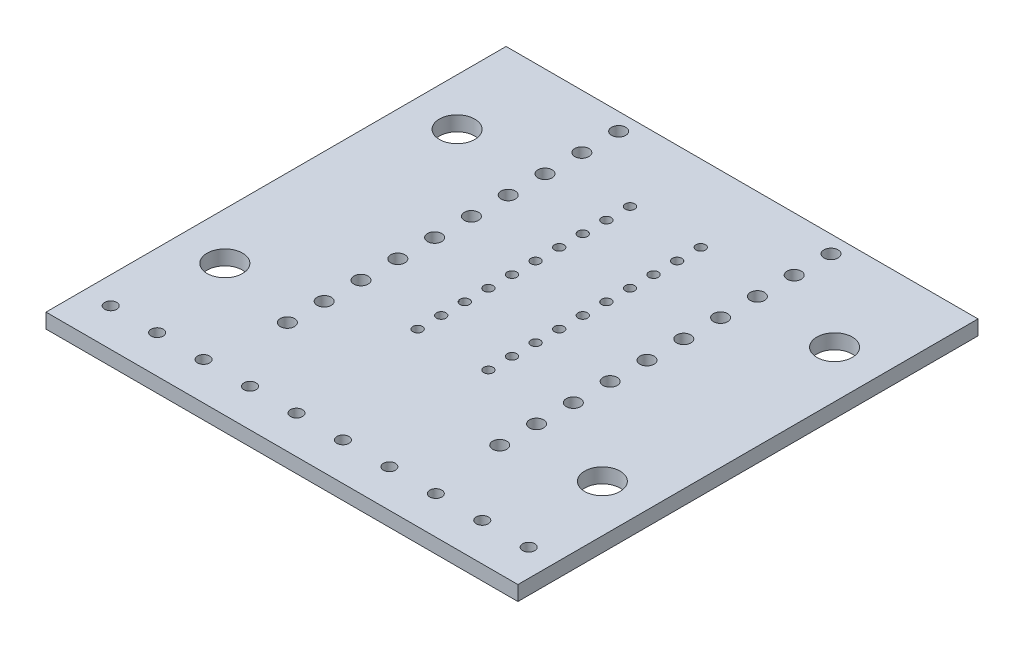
from build123d import *

# Parameters (mm, degrees)
SKETCH1_W           = 50.8
SKETCH1_H           = 49.53
SKETCH1_R           = 0.65
SKETCH1_R_2         = 1.905
SKETCH1_R_3         = 0.762
SKETCH1_R_4         = 0.508
BOSS_EXTRUDE1_DEPTH = 1.5875


with BuildPart() as part:
    # Sketch1 → Boss-Extrude1 (new body)
    with BuildSketch(Plane(origin=(0, 0, 0), x_dir=(1, 0, 0), z_dir=(0, 1, 0))):
        with Locations((0, 24.765)):
            Rectangle(SKETCH1_W, SKETCH1_H)
        with Locations(Location((-22.49932, 4.064, 0), (0, 0, 270))):
            Circle(SKETCH1_R, mode=Mode.SUBTRACT)
        with Locations(Location((-17.5006, 4.064, 0), (0, 0, 270))):
            Circle(SKETCH1_R, mode=Mode.SUBTRACT)
        with Locations(Location((-12.49934, 4.064, 0), (0, 0, 270))):
            Circle(SKETCH1_R, mode=Mode.SUBTRACT)
        with Locations(Location((-7.50062, 4.064, 0), (0, 0, 270))):
            Circle(SKETCH1_R, mode=Mode.SUBTRACT)
        with Locations(Location((-2.49936, 4.064, 0), (0, 0, 270))):
            Circle(SKETCH1_R, mode=Mode.SUBTRACT)
        with Locations(Location((-20.32, 14.1732, 0), (0, 0, 270))):
            Circle(SKETCH1_R_2, mode=Mode.SUBTRACT)
        with Locations(Location((-20.32, 39.16934, 0), (0, 0, 270))):
            Circle(SKETCH1_R_2, mode=Mode.SUBTRACT)
        with Locations(Location((-11.43, 12.0142, 0), (0, 0, 270))):
            Circle(SKETCH1_R_3, mode=Mode.SUBTRACT)
        with Locations(Location((-11.43, 15.9766, 0), (0, 0, 270))):
            Circle(SKETCH1_R_3, mode=Mode.SUBTRACT)
        with Locations(Location((-11.43, 19.939, 0), (0, 0, 270))):
            Circle(SKETCH1_R_3, mode=Mode.SUBTRACT)
        with Locations(Location((-11.43, 23.9014, 0), (0, 0, 270))):
            Circle(SKETCH1_R_3, mode=Mode.SUBTRACT)
        with Locations(Location((-11.43, 27.8638, 0), (0, 0, 270))):
            Circle(SKETCH1_R_3, mode=Mode.SUBTRACT)
        with Locations(Location((-11.43, 31.8262, 0), (0, 0, 270))):
            Circle(SKETCH1_R_3, mode=Mode.SUBTRACT)
        with Locations(Location((-11.43, 35.7886, 0), (0, 0, 270))):
            Circle(SKETCH1_R_3, mode=Mode.SUBTRACT)
        with Locations(Location((-11.43, 39.751, 0), (0, 0, 270))):
            Circle(SKETCH1_R_3, mode=Mode.SUBTRACT)
        with Locations(Location((-11.43, 43.7134, 0), (0, 0, 270))):
            Circle(SKETCH1_R_3, mode=Mode.SUBTRACT)
        with Locations(Location((-11.43, 47.6758, 0), (0, 0, 270))):
            Circle(SKETCH1_R_3, mode=Mode.SUBTRACT)
        with Locations(Location((-3.81, 18.415, 0), (0, 0, 270))):
            Circle(SKETCH1_R_4, mode=Mode.SUBTRACT)
        with Locations(Location((3.81, 41.275, 0), (0, 0, 90))):
            Circle(SKETCH1_R_4, mode=Mode.SUBTRACT)
        with Locations(Location((3.81, 38.735, 0), (0, 0, 90))):
            Circle(SKETCH1_R_4, mode=Mode.SUBTRACT)
        with Locations(Location((3.81, 36.195, 0), (0, 0, 90))):
            Circle(SKETCH1_R_4, mode=Mode.SUBTRACT)
        with Locations(Location((3.81, 33.655, 0), (0, 0, 90))):
            Circle(SKETCH1_R_4, mode=Mode.SUBTRACT)
        with Locations(Location((3.81, 31.115, 0), (0, 0, 90))):
            Circle(SKETCH1_R_4, mode=Mode.SUBTRACT)
        with Locations(Location((3.81, 28.575, 0), (0, 0, 90))):
            Circle(SKETCH1_R_4, mode=Mode.SUBTRACT)
        with Locations(Location((3.81, 26.035, 0), (0, 0, 90))):
            Circle(SKETCH1_R_4, mode=Mode.SUBTRACT)
        with Locations(Location((3.81, 23.495, 0), (0, 0, 90))):
            Circle(SKETCH1_R_4, mode=Mode.SUBTRACT)
        with Locations(Location((3.81, 20.955, 0), (0, 0, 90))):
            Circle(SKETCH1_R_4, mode=Mode.SUBTRACT)
        with Locations(Location((3.81, 18.415, 0), (0, 0, 90))):
            Circle(SKETCH1_R_4, mode=Mode.SUBTRACT)
        with Locations(Location((-3.81, 20.955, 0), (0, 0, 270))):
            Circle(SKETCH1_R_4, mode=Mode.SUBTRACT)
        with Locations(Location((-3.81, 23.495, 0), (0, 0, 270))):
            Circle(SKETCH1_R_4, mode=Mode.SUBTRACT)
        with Locations(Location((-3.81, 26.035, 0), (0, 0, 270))):
            Circle(SKETCH1_R_4, mode=Mode.SUBTRACT)
        with Locations(Location((-3.81, 28.575, 0), (0, 0, 270))):
            Circle(SKETCH1_R_4, mode=Mode.SUBTRACT)
        with Locations(Location((-3.81, 31.115, 0), (0, 0, 270))):
            Circle(SKETCH1_R_4, mode=Mode.SUBTRACT)
        with Locations(Location((-3.81, 33.655, 0), (0, 0, 270))):
            Circle(SKETCH1_R_4, mode=Mode.SUBTRACT)
        with Locations(Location((-3.81, 36.195, 0), (0, 0, 270))):
            Circle(SKETCH1_R_4, mode=Mode.SUBTRACT)
        with Locations(Location((-3.81, 38.735, 0), (0, 0, 270))):
            Circle(SKETCH1_R_4, mode=Mode.SUBTRACT)
        with Locations(Location((-3.81, 41.275, 0), (0, 0, 270))):
            Circle(SKETCH1_R_4, mode=Mode.SUBTRACT)
        with Locations(Location((11.43, 47.6758, 0), (0, 0, 90))):
            Circle(SKETCH1_R_3, mode=Mode.SUBTRACT)
        with Locations(Location((11.43, 43.7134, 0), (0, 0, 90))):
            Circle(SKETCH1_R_3, mode=Mode.SUBTRACT)
        with Locations(Location((11.43, 39.751, 0), (0, 0, 90))):
            Circle(SKETCH1_R_3, mode=Mode.SUBTRACT)
        with Locations(Location((11.43, 35.7886, 0), (0, 0, 90))):
            Circle(SKETCH1_R_3, mode=Mode.SUBTRACT)
        with Locations(Location((11.43, 31.8262, 0), (0, 0, 90))):
            Circle(SKETCH1_R_3, mode=Mode.SUBTRACT)
        with Locations(Location((11.43, 27.8638, 0), (0, 0, 90))):
            Circle(SKETCH1_R_3, mode=Mode.SUBTRACT)
        with Locations(Location((11.43, 23.9014, 0), (0, 0, 90))):
            Circle(SKETCH1_R_3, mode=Mode.SUBTRACT)
        with Locations(Location((11.43, 19.939, 0), (0, 0, 90))):
            Circle(SKETCH1_R_3, mode=Mode.SUBTRACT)
        with Locations(Location((11.43, 15.9766, 0), (0, 0, 90))):
            Circle(SKETCH1_R_3, mode=Mode.SUBTRACT)
        with Locations(Location((11.43, 12.0142, 0), (0, 0, 90))):
            Circle(SKETCH1_R_3, mode=Mode.SUBTRACT)
        with Locations(Location((20.32, 39.16934, 0), (0, 0, 90))):
            Circle(SKETCH1_R_2, mode=Mode.SUBTRACT)
        with Locations(Location((20.32, 14.1732, 0), (0, 0, 90))):
            Circle(SKETCH1_R_2, mode=Mode.SUBTRACT)
        with Locations(Location((2.49936, 4.064, 0), (0, 0, 90))):
            Circle(SKETCH1_R, mode=Mode.SUBTRACT)
        with Locations(Location((7.50062, 4.064, 0), (0, 0, 90))):
            Circle(SKETCH1_R, mode=Mode.SUBTRACT)
        with Locations(Location((12.49934, 4.064, 0), (0, 0, 90))):
            Circle(SKETCH1_R, mode=Mode.SUBTRACT)
        with Locations(Location((17.5006, 4.064, 0), (0, 0, 90))):
            Circle(SKETCH1_R, mode=Mode.SUBTRACT)
        with Locations(Location((22.49932, 4.064, 0), (0, 0, 90))):
            Circle(SKETCH1_R, mode=Mode.SUBTRACT)
    extrude(amount=BOSS_EXTRUDE1_DEPTH)


solid = part.part
